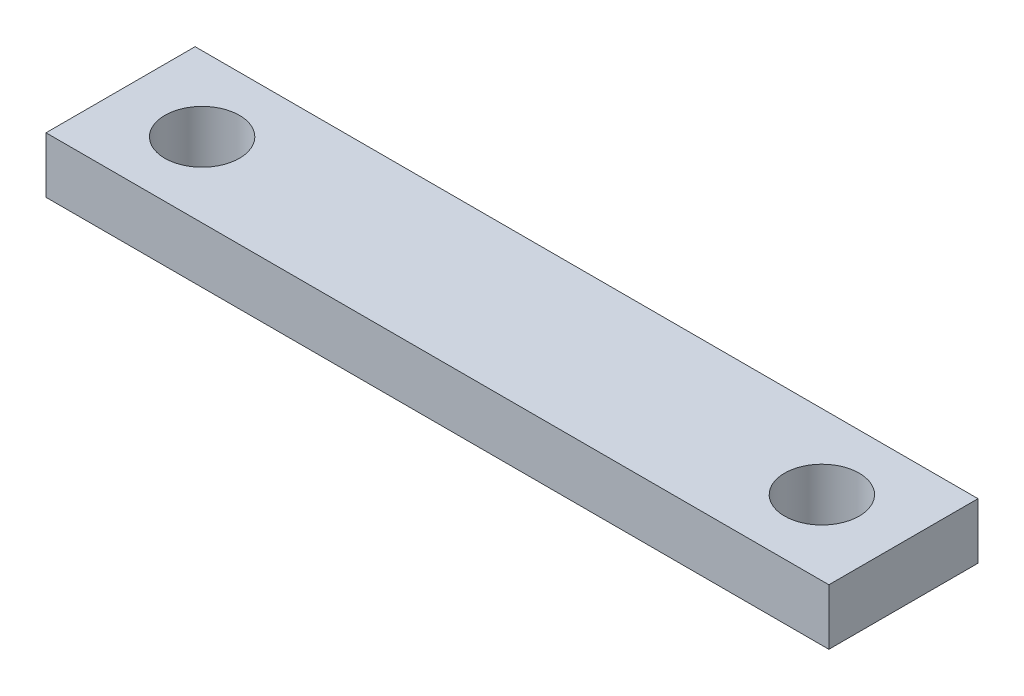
ISO-10303-21;
HEADER;
FILE_DESCRIPTION(('STEP AP214'),'2;1');
FILE_NAME('part.step','',(''),(''),'','','');
FILE_SCHEMA(('AUTOMOTIVE_DESIGN { 1 0 10303 214 1 1 1 1 }'));
ENDSEC;
DATA;
#1=APPLICATION_CONTEXT('core data for automotive mechanical design processes');
#2=APPLICATION_PROTOCOL_DEFINITION('international standard','automotive_design',2000,#1);
#3=PRODUCT_CONTEXT('',#1,'mechanical');
#4=PRODUCT('Part','Part','',(#3));
#5=PRODUCT_RELATED_PRODUCT_CATEGORY('part','',(#4));
#6=PRODUCT_DEFINITION_FORMATION('','',#4);
#7=PRODUCT_DEFINITION_CONTEXT('part definition',#1,'design');
#8=PRODUCT_DEFINITION('design','',#6,#7);
#9=PRODUCT_DEFINITION_SHAPE('','',#8);
#10=(LENGTH_UNIT() NAMED_UNIT(*) SI_UNIT(.MILLI.,.METRE.));
#11=(NAMED_UNIT(*) PLANE_ANGLE_UNIT() SI_UNIT($,.RADIAN.));
#12=(NAMED_UNIT(*) SI_UNIT($,.STERADIAN.) SOLID_ANGLE_UNIT());
#13=UNCERTAINTY_MEASURE_WITH_UNIT(LENGTH_MEASURE(1.E-05),#10,'distance_accuracy_value','');
#14=(GEOMETRIC_REPRESENTATION_CONTEXT(3) GLOBAL_UNCERTAINTY_ASSIGNED_CONTEXT((#13)) GLOBAL_UNIT_ASSIGNED_CONTEXT((#10,
#11,#12)) REPRESENTATION_CONTEXT('',''));
#15=CARTESIAN_POINT('',(0.,0.,0.));
#16=DIRECTION('',(0.,0.,1.));
#17=DIRECTION('',(1.,0.,0.));
#18=AXIS2_PLACEMENT_3D('',#15,#16,#17);
#19=CARTESIAN_POINT('',(0.,9.525,0.));
#20=DIRECTION('',(0.,1.,0.));
#21=DIRECTION('',(0.,0.,1.));
#22=AXIS2_PLACEMENT_3D('',#19,#20,#21);
#23=PLANE('',#22);
#24=DIRECTION('',(0.,0.,1.));
#25=VECTOR('',#24,1.);
#26=CARTESIAN_POINT('',(-66.675,9.525,-12.7));
#27=LINE('',#26,#25);
#28=CARTESIAN_POINT('',(-66.675,9.525,-12.7));
#29=VERTEX_POINT('',#28);
#30=CARTESIAN_POINT('',(-66.675,9.525,12.7));
#31=VERTEX_POINT('',#30);
#32=EDGE_CURVE('E85',#29,#31,#27,.T.);
#33=ORIENTED_EDGE('',*,*,#32,.T.);
#34=DIRECTION('',(1.,0.,0.));
#35=VECTOR('',#34,1.);
#36=CARTESIAN_POINT('',(-66.675,9.525,12.7));
#37=LINE('',#36,#35);
#38=CARTESIAN_POINT('',(66.675,9.525,12.7));
#39=VERTEX_POINT('',#38);
#40=EDGE_CURVE('E80',#31,#39,#37,.T.);
#41=ORIENTED_EDGE('',*,*,#40,.T.);
#42=DIRECTION('',(0.,0.,-1.));
#43=VECTOR('',#42,1.);
#44=CARTESIAN_POINT('',(66.675,9.525,-12.7));
#45=LINE('',#44,#43);
#46=CARTESIAN_POINT('',(66.675,9.525,-12.7));
#47=VERTEX_POINT('',#46);
#48=EDGE_CURVE('E83',#39,#47,#45,.T.);
#49=ORIENTED_EDGE('',*,*,#48,.T.);
#50=DIRECTION('',(-1.,0.,0.));
#51=VECTOR('',#50,1.);
#52=CARTESIAN_POINT('',(-66.675,9.525,-12.7));
#53=LINE('',#52,#51);
#54=EDGE_CURVE('E50',#47,#29,#53,.T.);
#55=ORIENTED_EDGE('',*,*,#54,.T.);
#56=EDGE_LOOP('',(#33,#41,#49,#55));
#57=FACE_BOUND('',#56,.T.);
#58=CARTESIAN_POINT('',(52.7812,9.525,0.));
#59=DIRECTION('',(0.,1.,0.));
#60=DIRECTION('',(0.,0.,1.));
#61=AXIS2_PLACEMENT_3D('',#58,#59,#60);
#62=CIRCLE('',#61,6.35);
#63=CARTESIAN_POINT('',(52.7812,9.525,6.35));
#64=VERTEX_POINT('',#63);
#65=EDGE_CURVE('E112',#64,#64,#62,.T.);
#66=ORIENTED_EDGE('',*,*,#65,.F.);
#67=EDGE_LOOP('',(#66));
#68=FACE_BOUND('',#67,.T.);
#69=CARTESIAN_POINT('',(-52.7812,9.525,0.));
#70=DIRECTION('',(0.,-1.,0.));
#71=DIRECTION('',(0.,0.,1.));
#72=AXIS2_PLACEMENT_3D('',#69,#70,#71);
#73=CIRCLE('',#72,6.35);
#74=CARTESIAN_POINT('',(-52.7812,9.525,6.35));
#75=VERTEX_POINT('',#74);
#76=EDGE_CURVE('E118',#75,#75,#73,.T.);
#77=ORIENTED_EDGE('',*,*,#76,.T.);
#78=EDGE_LOOP('',(#77));
#79=FACE_BOUND('',#78,.T.);
#80=ADVANCED_FACE('F33',(#57,#68,#79),#23,.T.);
#81=CARTESIAN_POINT('',(0.,0.,0.));
#82=DIRECTION('',(0.,1.,0.));
#83=DIRECTION('',(0.,0.,1.));
#84=AXIS2_PLACEMENT_3D('',#81,#82,#83);
#85=PLANE('',#84);
#86=DIRECTION('',(0.,0.,1.));
#87=VECTOR('',#86,1.);
#88=CARTESIAN_POINT('',(-66.675,0.,-12.7));
#89=LINE('',#88,#87);
#90=CARTESIAN_POINT('',(-66.675,0.,-12.7));
#91=VERTEX_POINT('',#90);
#92=CARTESIAN_POINT('',(-66.675,0.,12.7));
#93=VERTEX_POINT('',#92);
#94=EDGE_CURVE('E97',#91,#93,#89,.T.);
#95=ORIENTED_EDGE('',*,*,#94,.F.);
#96=DIRECTION('',(-1.,0.,0.));
#97=VECTOR('',#96,1.);
#98=CARTESIAN_POINT('',(-66.675,0.,-12.7));
#99=LINE('',#98,#97);
#100=CARTESIAN_POINT('',(66.675,0.,-12.7));
#101=VERTEX_POINT('',#100);
#102=EDGE_CURVE('E73',#101,#91,#99,.T.);
#103=ORIENTED_EDGE('',*,*,#102,.F.);
#104=DIRECTION('',(0.,0.,-1.));
#105=VECTOR('',#104,1.);
#106=CARTESIAN_POINT('',(66.675,0.,-12.7));
#107=LINE('',#106,#105);
#108=CARTESIAN_POINT('',(66.675,0.,12.7));
#109=VERTEX_POINT('',#108);
#110=EDGE_CURVE('E67',#109,#101,#107,.T.);
#111=ORIENTED_EDGE('',*,*,#110,.F.);
#112=DIRECTION('',(1.,0.,0.));
#113=VECTOR('',#112,1.);
#114=CARTESIAN_POINT('',(-66.675,0.,12.7));
#115=LINE('',#114,#113);
#116=EDGE_CURVE('E89',#93,#109,#115,.T.);
#117=ORIENTED_EDGE('',*,*,#116,.F.);
#118=EDGE_LOOP('',(#95,#103,#111,#117));
#119=FACE_BOUND('',#118,.T.);
#120=CARTESIAN_POINT('',(52.7812,0.,0.));
#121=DIRECTION('',(0.,1.,0.));
#122=DIRECTION('',(0.,0.,1.));
#123=AXIS2_PLACEMENT_3D('',#120,#121,#122);
#124=CIRCLE('',#123,6.35);
#125=CARTESIAN_POINT('',(52.7812,0.,6.35));
#126=VERTEX_POINT('',#125);
#127=EDGE_CURVE('E100',#126,#126,#124,.T.);
#128=ORIENTED_EDGE('',*,*,#127,.T.);
#129=EDGE_LOOP('',(#128));
#130=FACE_BOUND('',#129,.T.);
#131=CARTESIAN_POINT('',(-52.7812,0.,0.));
#132=DIRECTION('',(0.,-1.,0.));
#133=DIRECTION('',(0.,0.,1.));
#134=AXIS2_PLACEMENT_3D('',#131,#132,#133);
#135=CIRCLE('',#134,6.35);
#136=CARTESIAN_POINT('',(-52.7812,0.,6.35));
#137=VERTEX_POINT('',#136);
#138=EDGE_CURVE('E115',#137,#137,#135,.T.);
#139=ORIENTED_EDGE('',*,*,#138,.F.);
#140=EDGE_LOOP('',(#139));
#141=FACE_BOUND('',#140,.T.);
#142=ADVANCED_FACE('F108',(#119,#130,#141),#85,.F.);
#143=CARTESIAN_POINT('',(-66.675,9.525,-12.7));
#144=DIRECTION('',(1.,0.,0.));
#145=DIRECTION('',(0.,0.,-1.));
#146=AXIS2_PLACEMENT_3D('',#143,#144,#145);
#147=PLANE('',#146);
#148=ORIENTED_EDGE('',*,*,#94,.T.);
#149=DIRECTION('',(0.,-1.,0.));
#150=VECTOR('',#149,1.);
#151=CARTESIAN_POINT('',(-66.675,9.525,12.7));
#152=LINE('',#151,#150);
#153=EDGE_CURVE('E11',#31,#93,#152,.T.);
#154=ORIENTED_EDGE('',*,*,#153,.F.);
#155=ORIENTED_EDGE('',*,*,#32,.F.);
#156=DIRECTION('',(0.,-1.,0.));
#157=VECTOR('',#156,1.);
#158=CARTESIAN_POINT('',(-66.675,9.525,-12.7));
#159=LINE('',#158,#157);
#160=EDGE_CURVE('E93',#29,#91,#159,.T.);
#161=ORIENTED_EDGE('',*,*,#160,.T.);
#162=EDGE_LOOP('',(#148,#154,#155,#161));
#163=FACE_BOUND('',#162,.T.);
#164=ADVANCED_FACE('F35',(#163),#147,.F.);
#165=CARTESIAN_POINT('',(-66.675,9.525,12.7));
#166=DIRECTION('',(0.,0.,-1.));
#167=DIRECTION('',(-1.,0.,0.));
#168=AXIS2_PLACEMENT_3D('',#165,#166,#167);
#169=PLANE('',#168);
#170=ORIENTED_EDGE('',*,*,#116,.T.);
#171=DIRECTION('',(0.,-1.,0.));
#172=VECTOR('',#171,1.);
#173=CARTESIAN_POINT('',(66.675,9.525,12.7));
#174=LINE('',#173,#172);
#175=EDGE_CURVE('E42',#39,#109,#174,.T.);
#176=ORIENTED_EDGE('',*,*,#175,.F.);
#177=ORIENTED_EDGE('',*,*,#40,.F.);
#178=ORIENTED_EDGE('',*,*,#153,.T.);
#179=EDGE_LOOP('',(#170,#176,#177,#178));
#180=FACE_BOUND('',#179,.T.);
#181=ADVANCED_FACE('F88',(#180),#169,.F.);
#182=CARTESIAN_POINT('',(66.675,9.525,-12.7));
#183=DIRECTION('',(-1.,0.,0.));
#184=DIRECTION('',(0.,0.,1.));
#185=AXIS2_PLACEMENT_3D('',#182,#183,#184);
#186=PLANE('',#185);
#187=ORIENTED_EDGE('',*,*,#110,.T.);
#188=DIRECTION('',(0.,-1.,0.));
#189=VECTOR('',#188,1.);
#190=CARTESIAN_POINT('',(66.675,9.525,-12.7));
#191=LINE('',#190,#189);
#192=EDGE_CURVE('E90',#47,#101,#191,.T.);
#193=ORIENTED_EDGE('',*,*,#192,.F.);
#194=ORIENTED_EDGE('',*,*,#48,.F.);
#195=ORIENTED_EDGE('',*,*,#175,.T.);
#196=EDGE_LOOP('',(#187,#193,#194,#195));
#197=FACE_BOUND('',#196,.T.);
#198=ADVANCED_FACE('F91',(#197),#186,.F.);
#199=CARTESIAN_POINT('',(-66.675,9.525,-12.7));
#200=DIRECTION('',(0.,0.,1.));
#201=DIRECTION('',(1.,0.,0.));
#202=AXIS2_PLACEMENT_3D('',#199,#200,#201);
#203=PLANE('',#202);
#204=ORIENTED_EDGE('',*,*,#102,.T.);
#205=ORIENTED_EDGE('',*,*,#160,.F.);
#206=ORIENTED_EDGE('',*,*,#54,.F.);
#207=ORIENTED_EDGE('',*,*,#192,.T.);
#208=EDGE_LOOP('',(#204,#205,#206,#207));
#209=FACE_BOUND('',#208,.T.);
#210=ADVANCED_FACE('F105',(#209),#203,.F.);
#211=CARTESIAN_POINT('',(52.7812,0.,0.));
#212=DIRECTION('',(0.,1.,0.));
#213=DIRECTION('',(0.,0.,1.));
#214=AXIS2_PLACEMENT_3D('',#211,#212,#213);
#215=CYLINDRICAL_SURFACE('',#214,6.35);
#216=CARTESIAN_POINT('',(52.7812,0.,6.35));
#217=CARTESIAN_POINT('',(52.7812,0.0992187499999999,6.35));
#218=CARTESIAN_POINT('',(52.7812,0.1984375,6.35));
#219=CARTESIAN_POINT('',(52.7812,0.396875,6.35));
#220=CARTESIAN_POINT('',(52.7812,0.49609375,6.35));
#221=CARTESIAN_POINT('',(52.7812,0.69453125,6.35));
#222=CARTESIAN_POINT('',(52.7812,0.79375,6.35));
#223=CARTESIAN_POINT('',(52.7812,0.9921875,6.35));
#224=CARTESIAN_POINT('',(52.7812,1.09140625,6.35));
#225=CARTESIAN_POINT('',(52.7812,1.28984375,6.35));
#226=CARTESIAN_POINT('',(52.7812,1.3890625,6.35));
#227=CARTESIAN_POINT('',(52.7812,1.5875,6.35));
#228=CARTESIAN_POINT('',(52.7812,1.68671875,6.35));
#229=CARTESIAN_POINT('',(52.7812,1.88515625,6.35));
#230=CARTESIAN_POINT('',(52.7812,1.984375,6.35));
#231=CARTESIAN_POINT('',(52.7812,2.1828125,6.35));
#232=CARTESIAN_POINT('',(52.7812,2.28203125,6.35));
#233=CARTESIAN_POINT('',(52.7812,2.48046875,6.35));
#234=CARTESIAN_POINT('',(52.7812,2.5796875,6.35));
#235=CARTESIAN_POINT('',(52.7812,2.778125,6.35));
#236=CARTESIAN_POINT('',(52.7812,2.87734375,6.35));
#237=CARTESIAN_POINT('',(52.7812,3.07578125,6.35));
#238=CARTESIAN_POINT('',(52.7812,3.175,6.35));
#239=CARTESIAN_POINT('',(52.7812,3.3734375,6.35));
#240=CARTESIAN_POINT('',(52.7812,3.47265625,6.35));
#241=CARTESIAN_POINT('',(52.7812,3.67109375,6.35));
#242=CARTESIAN_POINT('',(52.7812,3.7703125,6.35));
#243=CARTESIAN_POINT('',(52.7812,3.96875,6.35));
#244=CARTESIAN_POINT('',(52.7812,4.06796875,6.35));
#245=CARTESIAN_POINT('',(52.7812,4.26640625,6.35));
#246=CARTESIAN_POINT('',(52.7812,4.365625,6.35));
#247=CARTESIAN_POINT('',(52.7812,4.5640625,6.35));
#248=CARTESIAN_POINT('',(52.7812,4.66328125,6.35));
#249=CARTESIAN_POINT('',(52.7812,4.86171875,6.35));
#250=CARTESIAN_POINT('',(52.7812,4.9609375,6.35));
#251=CARTESIAN_POINT('',(52.7812,5.159375,6.35));
#252=CARTESIAN_POINT('',(52.7812,5.25859375,6.35));
#253=CARTESIAN_POINT('',(52.7812,5.45703125,6.35));
#254=CARTESIAN_POINT('',(52.7812,5.55625,6.35));
#255=CARTESIAN_POINT('',(52.7812,5.7546875,6.35));
#256=CARTESIAN_POINT('',(52.7812,5.85390625,6.35));
#257=CARTESIAN_POINT('',(52.7812,6.05234375,6.35));
#258=CARTESIAN_POINT('',(52.7812,6.1515625,6.35));
#259=CARTESIAN_POINT('',(52.7812,6.35,6.35));
#260=CARTESIAN_POINT('',(52.7812,6.44921875,6.35));
#261=CARTESIAN_POINT('',(52.7812,6.64765625,6.35));
#262=CARTESIAN_POINT('',(52.7812,6.746875,6.35));
#263=CARTESIAN_POINT('',(52.7812,6.9453125,6.35));
#264=CARTESIAN_POINT('',(52.7812,7.04453125,6.35));
#265=CARTESIAN_POINT('',(52.7812,7.24296875,6.35));
#266=CARTESIAN_POINT('',(52.7812,7.3421875,6.35));
#267=CARTESIAN_POINT('',(52.7812,7.540625,6.35));
#268=CARTESIAN_POINT('',(52.7812,7.63984375,6.35));
#269=CARTESIAN_POINT('',(52.7812,7.83828125,6.35));
#270=CARTESIAN_POINT('',(52.7812,7.9375,6.35));
#271=CARTESIAN_POINT('',(52.7812,8.1359375,6.35));
#272=CARTESIAN_POINT('',(52.7812,8.23515625,6.35));
#273=CARTESIAN_POINT('',(52.7812,8.43359375,6.35));
#274=CARTESIAN_POINT('',(52.7812,8.5328125,6.35));
#275=CARTESIAN_POINT('',(52.7812,8.73125,6.35));
#276=CARTESIAN_POINT('',(52.7812,8.83046875,6.35));
#277=CARTESIAN_POINT('',(52.7812,9.02890625,6.35));
#278=CARTESIAN_POINT('',(52.7812,9.128125,6.35));
#279=CARTESIAN_POINT('',(52.7812,9.3265625,6.35));
#280=CARTESIAN_POINT('',(52.7812,9.42578125,6.35));
#281=CARTESIAN_POINT('',(52.7812,9.525,6.35));
#282=B_SPLINE_CURVE_WITH_KNOTS('',3,(#216,#217,#218,#219,#220,#221,#222,#223,#224,#225,#226,
#227,#228,#229,#230,#231,#232,#233,#234,#235,#236,#237,#238,#239,#240,#241,#242,#243,#244,#245,
#246,#247,#248,#249,#250,#251,#252,#253,#254,#255,#256,#257,#258,#259,#260,#261,#262,#263,#264,
#265,#266,#267,#268,#269,#270,#271,#272,#273,#274,#275,#276,#277,#278,#279,#280,#281),
.UNSPECIFIED.,.F.,.F.,(4,2,2,2,2,2,2,2,2,2,2,2,2,2,2,2,2,2,2,2,2,2,2,2,2,2,2,2,2,2,2,2,4),(0.,
0.29765625,0.5953125,0.89296875,1.190625,1.48828125,1.7859375,2.08359375,2.38125,2.67890625,
2.9765625,3.27421875,3.571875,3.86953125,4.1671875,4.46484375,4.7625,5.06015625,5.3578125,
5.65546875,5.953125,6.25078125,6.5484375,6.84609375,7.14375,7.44140625,7.7390625,8.03671875,
8.334375,8.63203125,8.9296875,9.22734375,9.525),.UNSPECIFIED.);
#283=EDGE_CURVE('BSEAM138',#126,#64,#282,.T.);
#284=ORIENTED_EDGE('',*,*,#127,.F.);
#285=ORIENTED_EDGE('',*,*,#65,.T.);
#286=ORIENTED_EDGE('',*,*,#283,.T.);
#287=ORIENTED_EDGE('',*,*,#283,.F.);
#288=EDGE_LOOP('',(#284,#286,#285,#287));
#289=FACE_BOUND('',#288,.T.);
#290=ADVANCED_FACE('F138',(#289),#215,.F.);
#291=CARTESIAN_POINT('',(-52.7812,0.,0.));
#292=DIRECTION('',(0.,1.,0.));
#293=DIRECTION('',(0.,0.,1.));
#294=AXIS2_PLACEMENT_3D('',#291,#292,#293);
#295=CYLINDRICAL_SURFACE('',#294,6.35);
#296=CARTESIAN_POINT('',(-52.7812,0.,6.35));
#297=CARTESIAN_POINT('',(-52.7812,0.0992187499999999,6.35));
#298=CARTESIAN_POINT('',(-52.7812,0.1984375,6.35));
#299=CARTESIAN_POINT('',(-52.7812,0.396875,6.35));
#300=CARTESIAN_POINT('',(-52.7812,0.49609375,6.35));
#301=CARTESIAN_POINT('',(-52.7812,0.69453125,6.35));
#302=CARTESIAN_POINT('',(-52.7812,0.79375,6.35));
#303=CARTESIAN_POINT('',(-52.7812,0.9921875,6.35));
#304=CARTESIAN_POINT('',(-52.7812,1.09140625,6.35));
#305=CARTESIAN_POINT('',(-52.7812,1.28984375,6.35));
#306=CARTESIAN_POINT('',(-52.7812,1.3890625,6.35));
#307=CARTESIAN_POINT('',(-52.7812,1.5875,6.35));
#308=CARTESIAN_POINT('',(-52.7812,1.68671875,6.35));
#309=CARTESIAN_POINT('',(-52.7812,1.88515625,6.35));
#310=CARTESIAN_POINT('',(-52.7812,1.984375,6.35));
#311=CARTESIAN_POINT('',(-52.7812,2.1828125,6.35));
#312=CARTESIAN_POINT('',(-52.7812,2.28203125,6.35));
#313=CARTESIAN_POINT('',(-52.7812,2.48046875,6.35));
#314=CARTESIAN_POINT('',(-52.7812,2.5796875,6.35));
#315=CARTESIAN_POINT('',(-52.7812,2.778125,6.35));
#316=CARTESIAN_POINT('',(-52.7812,2.87734375,6.35));
#317=CARTESIAN_POINT('',(-52.7812,3.07578125,6.35));
#318=CARTESIAN_POINT('',(-52.7812,3.175,6.35));
#319=CARTESIAN_POINT('',(-52.7812,3.3734375,6.35));
#320=CARTESIAN_POINT('',(-52.7812,3.47265625,6.35));
#321=CARTESIAN_POINT('',(-52.7812,3.67109375,6.35));
#322=CARTESIAN_POINT('',(-52.7812,3.7703125,6.35));
#323=CARTESIAN_POINT('',(-52.7812,3.96875,6.35));
#324=CARTESIAN_POINT('',(-52.7812,4.06796875,6.35));
#325=CARTESIAN_POINT('',(-52.7812,4.26640625,6.35));
#326=CARTESIAN_POINT('',(-52.7812,4.365625,6.35));
#327=CARTESIAN_POINT('',(-52.7812,4.5640625,6.35));
#328=CARTESIAN_POINT('',(-52.7812,4.66328125,6.35));
#329=CARTESIAN_POINT('',(-52.7812,4.86171875,6.35));
#330=CARTESIAN_POINT('',(-52.7812,4.9609375,6.35));
#331=CARTESIAN_POINT('',(-52.7812,5.159375,6.35));
#332=CARTESIAN_POINT('',(-52.7812,5.25859375,6.35));
#333=CARTESIAN_POINT('',(-52.7812,5.45703125,6.35));
#334=CARTESIAN_POINT('',(-52.7812,5.55625,6.35));
#335=CARTESIAN_POINT('',(-52.7812,5.7546875,6.35));
#336=CARTESIAN_POINT('',(-52.7812,5.85390625,6.35));
#337=CARTESIAN_POINT('',(-52.7812,6.05234375,6.35));
#338=CARTESIAN_POINT('',(-52.7812,6.1515625,6.35));
#339=CARTESIAN_POINT('',(-52.7812,6.35,6.35));
#340=CARTESIAN_POINT('',(-52.7812,6.44921875,6.35));
#341=CARTESIAN_POINT('',(-52.7812,6.64765625,6.35));
#342=CARTESIAN_POINT('',(-52.7812,6.746875,6.35));
#343=CARTESIAN_POINT('',(-52.7812,6.9453125,6.35));
#344=CARTESIAN_POINT('',(-52.7812,7.04453125,6.35));
#345=CARTESIAN_POINT('',(-52.7812,7.24296875,6.35));
#346=CARTESIAN_POINT('',(-52.7812,7.3421875,6.35));
#347=CARTESIAN_POINT('',(-52.7812,7.540625,6.35));
#348=CARTESIAN_POINT('',(-52.7812,7.63984375,6.35));
#349=CARTESIAN_POINT('',(-52.7812,7.83828125,6.35));
#350=CARTESIAN_POINT('',(-52.7812,7.9375,6.35));
#351=CARTESIAN_POINT('',(-52.7812,8.1359375,6.35));
#352=CARTESIAN_POINT('',(-52.7812,8.23515625,6.35));
#353=CARTESIAN_POINT('',(-52.7812,8.43359375,6.35));
#354=CARTESIAN_POINT('',(-52.7812,8.5328125,6.35));
#355=CARTESIAN_POINT('',(-52.7812,8.73125,6.35));
#356=CARTESIAN_POINT('',(-52.7812,8.83046875,6.35));
#357=CARTESIAN_POINT('',(-52.7812,9.02890625,6.35));
#358=CARTESIAN_POINT('',(-52.7812,9.128125,6.35));
#359=CARTESIAN_POINT('',(-52.7812,9.3265625,6.35));
#360=CARTESIAN_POINT('',(-52.7812,9.42578125,6.35));
#361=CARTESIAN_POINT('',(-52.7812,9.525,6.35));
#362=B_SPLINE_CURVE_WITH_KNOTS('',3,(#296,#297,#298,#299,#300,#301,#302,#303,#304,#305,#306,
#307,#308,#309,#310,#311,#312,#313,#314,#315,#316,#317,#318,#319,#320,#321,#322,#323,#324,#325,
#326,#327,#328,#329,#330,#331,#332,#333,#334,#335,#336,#337,#338,#339,#340,#341,#342,#343,#344,
#345,#346,#347,#348,#349,#350,#351,#352,#353,#354,#355,#356,#357,#358,#359,#360,#361),
.UNSPECIFIED.,.F.,.F.,(4,2,2,2,2,2,2,2,2,2,2,2,2,2,2,2,2,2,2,2,2,2,2,2,2,2,2,2,2,2,2,2,4),(0.,
0.29765625,0.5953125,0.89296875,1.190625,1.48828125,1.7859375,2.08359375,2.38125,2.67890625,
2.9765625,3.27421875,3.571875,3.86953125,4.1671875,4.46484375,4.7625,5.06015625,5.3578125,
5.65546875,5.953125,6.25078125,6.5484375,6.84609375,7.14375,7.44140625,7.7390625,8.03671875,
8.334375,8.63203125,8.9296875,9.22734375,9.525),.UNSPECIFIED.);
#363=EDGE_CURVE('BSEAM124',#137,#75,#362,.T.);
#364=ORIENTED_EDGE('',*,*,#138,.T.);
#365=ORIENTED_EDGE('',*,*,#76,.F.);
#366=ORIENTED_EDGE('',*,*,#363,.T.);
#367=ORIENTED_EDGE('',*,*,#363,.F.);
#368=EDGE_LOOP('',(#364,#366,#365,#367));
#369=FACE_BOUND('',#368,.T.);
#370=ADVANCED_FACE('F124',(#369),#295,.F.);
#371=CLOSED_SHELL('',(#80,#142,#164,#181,#198,#210,#290,#370));
#372=MANIFOLD_SOLID_BREP('B2',#371);
#373=ADVANCED_BREP_SHAPE_REPRESENTATION('',(#18,#372),#14);
#374=SHAPE_DEFINITION_REPRESENTATION(#9,#373);
ENDSEC;
END-ISO-10303-21;
